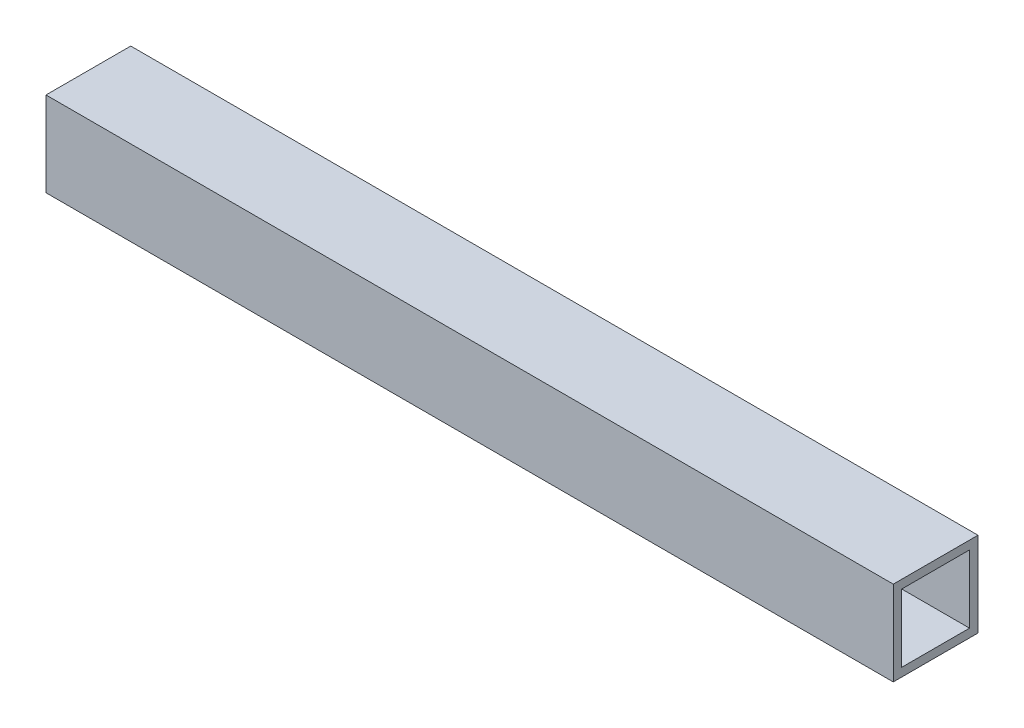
ISO-10303-21;
HEADER;
FILE_DESCRIPTION(('STEP AP214'),'2;1');
FILE_NAME('part.step','',(''),(''),'','','');
FILE_SCHEMA(('AUTOMOTIVE_DESIGN { 1 0 10303 214 1 1 1 1 }'));
ENDSEC;
DATA;
#1=APPLICATION_CONTEXT('core data for automotive mechanical design processes');
#2=APPLICATION_PROTOCOL_DEFINITION('international standard','automotive_design',2000,#1);
#3=PRODUCT_CONTEXT('',#1,'mechanical');
#4=PRODUCT('Part','Part','',(#3));
#5=PRODUCT_RELATED_PRODUCT_CATEGORY('part','',(#4));
#6=PRODUCT_DEFINITION_FORMATION('','',#4);
#7=PRODUCT_DEFINITION_CONTEXT('part definition',#1,'design');
#8=PRODUCT_DEFINITION('design','',#6,#7);
#9=PRODUCT_DEFINITION_SHAPE('','',#8);
#10=(LENGTH_UNIT() NAMED_UNIT(*) SI_UNIT(.MILLI.,.METRE.));
#11=(NAMED_UNIT(*) PLANE_ANGLE_UNIT() SI_UNIT($,.RADIAN.));
#12=(NAMED_UNIT(*) SI_UNIT($,.STERADIAN.) SOLID_ANGLE_UNIT());
#13=UNCERTAINTY_MEASURE_WITH_UNIT(LENGTH_MEASURE(1.E-05),#10,'distance_accuracy_value','');
#14=(GEOMETRIC_REPRESENTATION_CONTEXT(3) GLOBAL_UNCERTAINTY_ASSIGNED_CONTEXT((#13)) GLOBAL_UNIT_ASSIGNED_CONTEXT((#10,
#11,#12)) REPRESENTATION_CONTEXT('',''));
#15=CARTESIAN_POINT('',(0.,0.,0.));
#16=DIRECTION('',(0.,0.,1.));
#17=DIRECTION('',(1.,0.,0.));
#18=AXIS2_PLACEMENT_3D('',#15,#16,#17);
#19=CARTESIAN_POINT('',(100.,0.,0.));
#20=DIRECTION('',(-1.,0.,0.));
#21=DIRECTION('',(0.,0.,1.));
#22=AXIS2_PLACEMENT_3D('',#19,#20,#21);
#23=PLANE('',#22);
#24=DIRECTION('',(0.,-1.,0.));
#25=VECTOR('',#24,1.);
#26=CARTESIAN_POINT('',(100.,0.,0.));
#27=LINE('',#26,#25);
#28=CARTESIAN_POINT('',(100.,10.,0.));
#29=VERTEX_POINT('',#28);
#30=CARTESIAN_POINT('',(100.,0.,0.));
#31=VERTEX_POINT('',#30);
#32=EDGE_CURVE('E134',#29,#31,#27,.T.);
#33=ORIENTED_EDGE('',*,*,#32,.T.);
#34=DIRECTION('',(0.,0.,-1.));
#35=VECTOR('',#34,1.);
#36=CARTESIAN_POINT('',(100.,0.,0.));
#37=LINE('',#36,#35);
#38=CARTESIAN_POINT('',(100.,0.,-10.));
#39=VERTEX_POINT('',#38);
#40=EDGE_CURVE('E137',#31,#39,#37,.T.);
#41=ORIENTED_EDGE('',*,*,#40,.T.);
#42=DIRECTION('',(0.,1.,0.));
#43=VECTOR('',#42,1.);
#44=CARTESIAN_POINT('',(100.,0.,-10.));
#45=LINE('',#44,#43);
#46=CARTESIAN_POINT('',(100.,10.,-10.));
#47=VERTEX_POINT('',#46);
#48=EDGE_CURVE('E140',#39,#47,#45,.T.);
#49=ORIENTED_EDGE('',*,*,#48,.T.);
#50=DIRECTION('',(0.,0.,1.));
#51=VECTOR('',#50,1.);
#52=CARTESIAN_POINT('',(100.,10.,0.));
#53=LINE('',#52,#51);
#54=EDGE_CURVE('E142',#47,#29,#53,.T.);
#55=ORIENTED_EDGE('',*,*,#54,.T.);
#56=EDGE_LOOP('',(#33,#41,#49,#55));
#57=FACE_BOUND('',#56,.T.);
#58=DIRECTION('',(0.,-1.,0.));
#59=VECTOR('',#58,1.);
#60=CARTESIAN_POINT('',(100.,1.,-1.));
#61=LINE('',#60,#59);
#62=CARTESIAN_POINT('',(100.,9.,-1.));
#63=VERTEX_POINT('',#62);
#64=CARTESIAN_POINT('',(100.,1.,-1.));
#65=VERTEX_POINT('',#64);
#66=EDGE_CURVE('E98',#63,#65,#61,.T.);
#67=ORIENTED_EDGE('',*,*,#66,.F.);
#68=DIRECTION('',(0.,0.,1.));
#69=VECTOR('',#68,1.);
#70=CARTESIAN_POINT('',(100.,9.,-1.));
#71=LINE('',#70,#69);
#72=CARTESIAN_POINT('',(100.,9.,-9.));
#73=VERTEX_POINT('',#72);
#74=EDGE_CURVE('E120',#73,#63,#71,.T.);
#75=ORIENTED_EDGE('',*,*,#74,.F.);
#76=DIRECTION('',(0.,1.,0.));
#77=VECTOR('',#76,1.);
#78=CARTESIAN_POINT('',(100.,1.,-9.));
#79=LINE('',#78,#77);
#80=CARTESIAN_POINT('',(100.,1.,-9.));
#81=VERTEX_POINT('',#80);
#82=EDGE_CURVE('E118',#81,#73,#79,.T.);
#83=ORIENTED_EDGE('',*,*,#82,.F.);
#84=DIRECTION('',(0.,0.,-1.));
#85=VECTOR('',#84,1.);
#86=CARTESIAN_POINT('',(100.,1.,-1.));
#87=LINE('',#86,#85);
#88=EDGE_CURVE('E106',#65,#81,#87,.T.);
#89=ORIENTED_EDGE('',*,*,#88,.F.);
#90=EDGE_LOOP('',(#67,#75,#83,#89));
#91=FACE_BOUND('',#90,.T.);
#92=ADVANCED_FACE('F33',(#57,#91),#23,.F.);
#93=CARTESIAN_POINT('',(0.,0.,0.));
#94=DIRECTION('',(-1.,0.,0.));
#95=DIRECTION('',(0.,0.,1.));
#96=AXIS2_PLACEMENT_3D('',#93,#94,#95);
#97=PLANE('',#96);
#98=DIRECTION('',(0.,-1.,0.));
#99=VECTOR('',#98,1.);
#100=CARTESIAN_POINT('',(0.,0.,0.));
#101=LINE('',#100,#99);
#102=CARTESIAN_POINT('',(0.,10.,0.));
#103=VERTEX_POINT('',#102);
#104=CARTESIAN_POINT('',(0.,0.,0.));
#105=VERTEX_POINT('',#104);
#106=EDGE_CURVE('E114',#103,#105,#101,.T.);
#107=ORIENTED_EDGE('',*,*,#106,.F.);
#108=DIRECTION('',(0.,0.,1.));
#109=VECTOR('',#108,1.);
#110=CARTESIAN_POINT('',(0.,10.,0.));
#111=LINE('',#110,#109);
#112=CARTESIAN_POINT('',(0.,10.,-10.));
#113=VERTEX_POINT('',#112);
#114=EDGE_CURVE('E138',#113,#103,#111,.T.);
#115=ORIENTED_EDGE('',*,*,#114,.F.);
#116=DIRECTION('',(0.,1.,0.));
#117=VECTOR('',#116,1.);
#118=CARTESIAN_POINT('',(0.,0.,-10.));
#119=LINE('',#118,#117);
#120=CARTESIAN_POINT('',(0.,0.,-10.));
#121=VERTEX_POINT('',#120);
#122=EDGE_CURVE('E149',#121,#113,#119,.T.);
#123=ORIENTED_EDGE('',*,*,#122,.F.);
#124=DIRECTION('',(0.,0.,-1.));
#125=VECTOR('',#124,1.);
#126=CARTESIAN_POINT('',(0.,0.,0.));
#127=LINE('',#126,#125);
#128=EDGE_CURVE('E147',#105,#121,#127,.T.);
#129=ORIENTED_EDGE('',*,*,#128,.F.);
#130=EDGE_LOOP('',(#107,#115,#123,#129));
#131=FACE_BOUND('',#130,.T.);
#132=DIRECTION('',(0.,0.,1.));
#133=VECTOR('',#132,1.);
#134=CARTESIAN_POINT('',(0.,9.,-1.));
#135=LINE('',#134,#133);
#136=CARTESIAN_POINT('',(0.,9.,-9.));
#137=VERTEX_POINT('',#136);
#138=CARTESIAN_POINT('',(0.,9.,-1.));
#139=VERTEX_POINT('',#138);
#140=EDGE_CURVE('E107',#137,#139,#135,.T.);
#141=ORIENTED_EDGE('',*,*,#140,.T.);
#142=DIRECTION('',(0.,-1.,0.));
#143=VECTOR('',#142,1.);
#144=CARTESIAN_POINT('',(0.,1.,-1.));
#145=LINE('',#144,#143);
#146=CARTESIAN_POINT('',(0.,1.,-1.));
#147=VERTEX_POINT('',#146);
#148=EDGE_CURVE('E56',#139,#147,#145,.T.);
#149=ORIENTED_EDGE('',*,*,#148,.T.);
#150=DIRECTION('',(0.,0.,-1.));
#151=VECTOR('',#150,1.);
#152=CARTESIAN_POINT('',(0.,1.,-1.));
#153=LINE('',#152,#151);
#154=CARTESIAN_POINT('',(0.,1.,-9.));
#155=VERTEX_POINT('',#154);
#156=EDGE_CURVE('E113',#147,#155,#153,.T.);
#157=ORIENTED_EDGE('',*,*,#156,.T.);
#158=DIRECTION('',(0.,1.,0.));
#159=VECTOR('',#158,1.);
#160=CARTESIAN_POINT('',(0.,1.,-9.));
#161=LINE('',#160,#159);
#162=EDGE_CURVE('E126',#155,#137,#161,.T.);
#163=ORIENTED_EDGE('',*,*,#162,.T.);
#164=EDGE_LOOP('',(#141,#149,#157,#163));
#165=FACE_BOUND('',#164,.T.);
#166=ADVANCED_FACE('F167',(#131,#165),#97,.T.);
#167=CARTESIAN_POINT('',(100.,0.,0.));
#168=DIRECTION('',(0.,0.,-1.));
#169=DIRECTION('',(-1.,0.,0.));
#170=AXIS2_PLACEMENT_3D('',#167,#168,#169);
#171=PLANE('',#170);
#172=ORIENTED_EDGE('',*,*,#106,.T.);
#173=DIRECTION('',(-1.,0.,0.));
#174=VECTOR('',#173,1.);
#175=CARTESIAN_POINT('',(100.,0.,0.));
#176=LINE('',#175,#174);
#177=EDGE_CURVE('E11',#31,#105,#176,.T.);
#178=ORIENTED_EDGE('',*,*,#177,.F.);
#179=ORIENTED_EDGE('',*,*,#32,.F.);
#180=DIRECTION('',(-1.,0.,0.));
#181=VECTOR('',#180,1.);
#182=CARTESIAN_POINT('',(100.,10.,0.));
#183=LINE('',#182,#181);
#184=EDGE_CURVE('E144',#29,#103,#183,.T.);
#185=ORIENTED_EDGE('',*,*,#184,.T.);
#186=EDGE_LOOP('',(#172,#178,#179,#185));
#187=FACE_BOUND('',#186,.T.);
#188=ADVANCED_FACE('F35',(#187),#171,.F.);
#189=CARTESIAN_POINT('',(100.,0.,0.));
#190=DIRECTION('',(0.,1.,0.));
#191=DIRECTION('',(0.,0.,1.));
#192=AXIS2_PLACEMENT_3D('',#189,#190,#191);
#193=PLANE('',#192);
#194=ORIENTED_EDGE('',*,*,#128,.T.);
#195=DIRECTION('',(-1.,0.,0.));
#196=VECTOR('',#195,1.);
#197=CARTESIAN_POINT('',(100.,0.,-10.));
#198=LINE('',#197,#196);
#199=EDGE_CURVE('E41',#39,#121,#198,.T.);
#200=ORIENTED_EDGE('',*,*,#199,.F.);
#201=ORIENTED_EDGE('',*,*,#40,.F.);
#202=ORIENTED_EDGE('',*,*,#177,.T.);
#203=EDGE_LOOP('',(#194,#200,#201,#202));
#204=FACE_BOUND('',#203,.T.);
#205=ADVANCED_FACE('F177',(#204),#193,.F.);
#206=CARTESIAN_POINT('',(100.,0.,-10.));
#207=DIRECTION('',(0.,0.,1.));
#208=DIRECTION('',(1.,0.,0.));
#209=AXIS2_PLACEMENT_3D('',#206,#207,#208);
#210=PLANE('',#209);
#211=ORIENTED_EDGE('',*,*,#122,.T.);
#212=DIRECTION('',(-1.,0.,0.));
#213=VECTOR('',#212,1.);
#214=CARTESIAN_POINT('',(100.,10.,-10.));
#215=LINE('',#214,#213);
#216=EDGE_CURVE('E154',#47,#113,#215,.T.);
#217=ORIENTED_EDGE('',*,*,#216,.F.);
#218=ORIENTED_EDGE('',*,*,#48,.F.);
#219=ORIENTED_EDGE('',*,*,#199,.T.);
#220=EDGE_LOOP('',(#211,#217,#218,#219));
#221=FACE_BOUND('',#220,.T.);
#222=ADVANCED_FACE('F161',(#221),#210,.F.);
#223=CARTESIAN_POINT('',(100.,10.,0.));
#224=DIRECTION('',(0.,-1.,0.));
#225=DIRECTION('',(0.,0.,-1.));
#226=AXIS2_PLACEMENT_3D('',#223,#224,#225);
#227=PLANE('',#226);
#228=ORIENTED_EDGE('',*,*,#114,.T.);
#229=ORIENTED_EDGE('',*,*,#184,.F.);
#230=ORIENTED_EDGE('',*,*,#54,.F.);
#231=ORIENTED_EDGE('',*,*,#216,.T.);
#232=EDGE_LOOP('',(#228,#229,#230,#231));
#233=FACE_BOUND('',#232,.T.);
#234=ADVANCED_FACE('F171',(#233),#227,.F.);
#235=CARTESIAN_POINT('',(100.,1.,-1.));
#236=DIRECTION('',(0.,0.,-1.));
#237=DIRECTION('',(-1.,0.,0.));
#238=AXIS2_PLACEMENT_3D('',#235,#236,#237);
#239=PLANE('',#238);
#240=ORIENTED_EDGE('',*,*,#148,.F.);
#241=DIRECTION('',(-1.,0.,0.));
#242=VECTOR('',#241,1.);
#243=CARTESIAN_POINT('',(100.,9.,-1.));
#244=LINE('',#243,#242);
#245=EDGE_CURVE('E102',#63,#139,#244,.T.);
#246=ORIENTED_EDGE('',*,*,#245,.F.);
#247=ORIENTED_EDGE('',*,*,#66,.T.);
#248=DIRECTION('',(-1.,0.,0.));
#249=VECTOR('',#248,1.);
#250=CARTESIAN_POINT('',(100.,1.,-1.));
#251=LINE('',#250,#249);
#252=EDGE_CURVE('E101',#65,#147,#251,.T.);
#253=ORIENTED_EDGE('',*,*,#252,.T.);
#254=EDGE_LOOP('',(#240,#246,#247,#253));
#255=FACE_BOUND('',#254,.T.);
#256=ADVANCED_FACE('F100',(#255),#239,.T.);
#257=CARTESIAN_POINT('',(100.,1.,-1.));
#258=DIRECTION('',(0.,1.,0.));
#259=DIRECTION('',(0.,0.,1.));
#260=AXIS2_PLACEMENT_3D('',#257,#258,#259);
#261=PLANE('',#260);
#262=ORIENTED_EDGE('',*,*,#156,.F.);
#263=ORIENTED_EDGE('',*,*,#252,.F.);
#264=ORIENTED_EDGE('',*,*,#88,.T.);
#265=DIRECTION('',(-1.,0.,0.));
#266=VECTOR('',#265,1.);
#267=CARTESIAN_POINT('',(100.,1.,-9.));
#268=LINE('',#267,#266);
#269=EDGE_CURVE('E115',#81,#155,#268,.T.);
#270=ORIENTED_EDGE('',*,*,#269,.T.);
#271=EDGE_LOOP('',(#262,#263,#264,#270));
#272=FACE_BOUND('',#271,.T.);
#273=ADVANCED_FACE('F110',(#272),#261,.T.);
#274=CARTESIAN_POINT('',(100.,1.,-9.));
#275=DIRECTION('',(0.,0.,1.));
#276=DIRECTION('',(1.,0.,0.));
#277=AXIS2_PLACEMENT_3D('',#274,#275,#276);
#278=PLANE('',#277);
#279=ORIENTED_EDGE('',*,*,#162,.F.);
#280=ORIENTED_EDGE('',*,*,#269,.F.);
#281=ORIENTED_EDGE('',*,*,#82,.T.);
#282=DIRECTION('',(-1.,0.,0.));
#283=VECTOR('',#282,1.);
#284=CARTESIAN_POINT('',(100.,9.,-9.));
#285=LINE('',#284,#283);
#286=EDGE_CURVE('E48',#73,#137,#285,.T.);
#287=ORIENTED_EDGE('',*,*,#286,.T.);
#288=EDGE_LOOP('',(#279,#280,#281,#287));
#289=FACE_BOUND('',#288,.T.);
#290=ADVANCED_FACE('F200',(#289),#278,.T.);
#291=CARTESIAN_POINT('',(100.,9.,-1.));
#292=DIRECTION('',(0.,-1.,0.));
#293=DIRECTION('',(0.,0.,-1.));
#294=AXIS2_PLACEMENT_3D('',#291,#292,#293);
#295=PLANE('',#294);
#296=ORIENTED_EDGE('',*,*,#140,.F.);
#297=ORIENTED_EDGE('',*,*,#286,.F.);
#298=ORIENTED_EDGE('',*,*,#74,.T.);
#299=ORIENTED_EDGE('',*,*,#245,.T.);
#300=EDGE_LOOP('',(#296,#297,#298,#299));
#301=FACE_BOUND('',#300,.T.);
#302=ADVANCED_FACE('F204',(#301),#295,.T.);
#303=CLOSED_SHELL('',(#92,#166,#188,#205,#222,#234,#256,#273,#290,#302));
#304=MANIFOLD_SOLID_BREP('B2',#303);
#305=ADVANCED_BREP_SHAPE_REPRESENTATION('',(#18,#304),#14);
#306=SHAPE_DEFINITION_REPRESENTATION(#9,#305);
ENDSEC;
END-ISO-10303-21;
